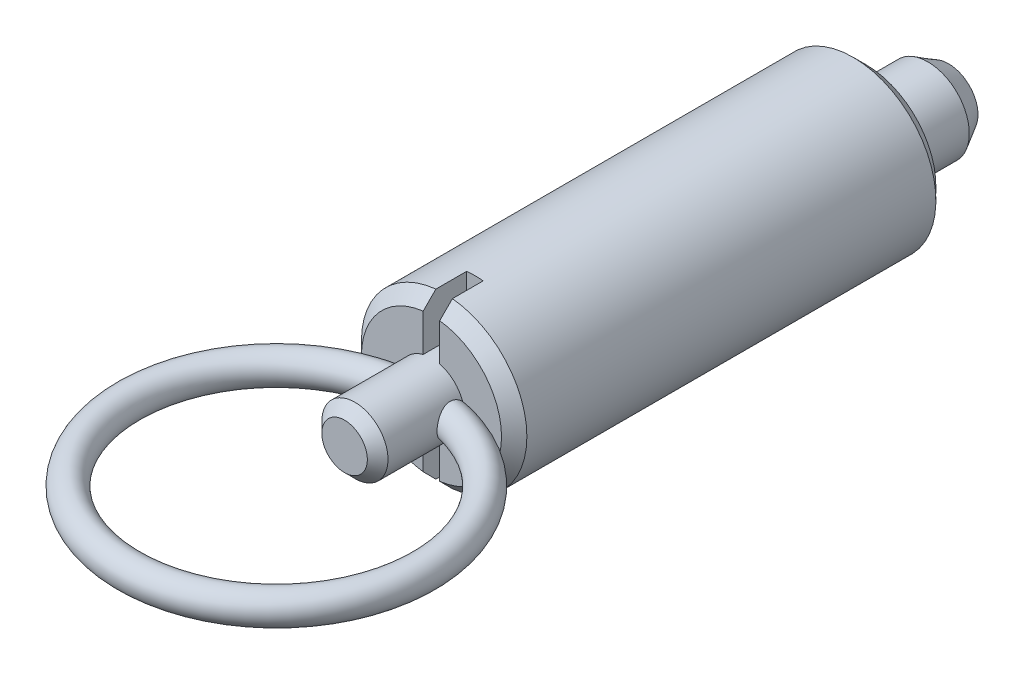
ISO-10303-21;
HEADER;
FILE_DESCRIPTION(('STEP AP214'),'2;1');
FILE_NAME('part.step','',(''),(''),'','','');
FILE_SCHEMA(('AUTOMOTIVE_DESIGN { 1 0 10303 214 1 1 1 1 }'));
ENDSEC;
DATA;
#1=APPLICATION_CONTEXT('core data for automotive mechanical design processes');
#2=APPLICATION_PROTOCOL_DEFINITION('international standard','automotive_design',2000,#1);
#3=PRODUCT_CONTEXT('',#1,'mechanical');
#4=PRODUCT('Part','Part','',(#3));
#5=PRODUCT_RELATED_PRODUCT_CATEGORY('part','',(#4));
#6=PRODUCT_DEFINITION_FORMATION('','',#4);
#7=PRODUCT_DEFINITION_CONTEXT('part definition',#1,'design');
#8=PRODUCT_DEFINITION('design','',#6,#7);
#9=PRODUCT_DEFINITION_SHAPE('','',#8);
#10=(LENGTH_UNIT() NAMED_UNIT(*) SI_UNIT(.MILLI.,.METRE.));
#11=(NAMED_UNIT(*) PLANE_ANGLE_UNIT() SI_UNIT($,.RADIAN.));
#12=(NAMED_UNIT(*) SI_UNIT($,.STERADIAN.) SOLID_ANGLE_UNIT());
#13=UNCERTAINTY_MEASURE_WITH_UNIT(LENGTH_MEASURE(1.E-05),#10,'distance_accuracy_value','');
#14=(GEOMETRIC_REPRESENTATION_CONTEXT(3) GLOBAL_UNCERTAINTY_ASSIGNED_CONTEXT((#13)) GLOBAL_UNIT_ASSIGNED_CONTEXT((#10,
#11,#12)) REPRESENTATION_CONTEXT('',''));
#15=CARTESIAN_POINT('',(0.,0.,0.));
#16=DIRECTION('',(0.,0.,1.));
#17=DIRECTION('',(1.,0.,0.));
#18=AXIS2_PLACEMENT_3D('',#15,#16,#17);
#19=CARTESIAN_POINT('',(-1.42264973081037,0.,-4.));
#20=DIRECTION('',(0.,0.,1.));
#21=DIRECTION('',(0.,1.,0.));
#22=AXIS2_PLACEMENT_3D('',#19,#20,#21);
#23=PLANE('',#22);
#24=CARTESIAN_POINT('',(0.,0.,-3.99999999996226));
#25=DIRECTION('',(0.,0.,1.));
#26=DIRECTION('',(0.,1.,0.));
#27=AXIS2_PLACEMENT_3D('',#24,#25,#26);
#28=CIRCLE('',#27,1.42264973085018);
#29=CARTESIAN_POINT('',(0.,1.42264973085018,-3.99999999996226));
#30=VERTEX_POINT('',#29);
#31=EDGE_CURVE('E158',#30,#30,#28,.T.);
#32=ORIENTED_EDGE('',*,*,#31,.F.);
#33=EDGE_LOOP('',(#32));
#34=FACE_BOUND('',#33,.T.);
#35=ADVANCED_FACE('F14',(#34),#23,.F.);
#36=CARTESIAN_POINT('',(0.,0.,-2.99999999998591));
#37=DIRECTION('',(0.,0.,1.));
#38=DIRECTION('',(0.,1.,0.));
#39=AXIS2_PLACEMENT_3D('',#36,#37,#38);
#40=CONICAL_SURFACE('',#39,2.00000000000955,0.523598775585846);
#41=CARTESIAN_POINT('',(0.,0.,-3.));
#42=DIRECTION('',(0.,0.,1.));
#43=DIRECTION('',(0.,1.,0.));
#44=AXIS2_PLACEMENT_3D('',#41,#42,#43);
#45=CIRCLE('',#44,2.);
#46=CARTESIAN_POINT('',(0.,2.,-3.));
#47=VERTEX_POINT('',#46);
#48=EDGE_CURVE('E157',#47,#47,#45,.T.);
#49=ORIENTED_EDGE('',*,*,#48,.F.);
#50=EDGE_LOOP('',(#49));
#51=FACE_BOUND('',#50,.T.);
#52=ORIENTED_EDGE('',*,*,#31,.T.);
#53=EDGE_LOOP('',(#52));
#54=FACE_BOUND('',#53,.T.);
#55=ADVANCED_FACE('F231',(#51,#54),#40,.T.);
#56=CARTESIAN_POINT('',(0.,0.,-4.));
#57=DIRECTION('',(0.,0.,1.));
#58=DIRECTION('',(0.,1.,0.));
#59=AXIS2_PLACEMENT_3D('',#56,#57,#58);
#60=CYLINDRICAL_SURFACE('',#59,2.);
#61=CARTESIAN_POINT('',(0.,0.,0.));
#62=DIRECTION('',(0.,0.,1.));
#63=DIRECTION('',(0.,1.,0.));
#64=AXIS2_PLACEMENT_3D('',#61,#62,#63);
#65=CIRCLE('',#64,2.);
#66=CARTESIAN_POINT('',(0.,2.,0.));
#67=VERTEX_POINT('',#66);
#68=EDGE_CURVE('E154',#67,#67,#65,.F.);
#69=ORIENTED_EDGE('',*,*,#68,.T.);
#70=EDGE_LOOP('',(#69));
#71=FACE_BOUND('',#70,.T.);
#72=ORIENTED_EDGE('',*,*,#48,.T.);
#73=EDGE_LOOP('',(#72));
#74=FACE_BOUND('',#73,.T.);
#75=ADVANCED_FACE('F227',(#71,#74),#60,.T.);
#76=CARTESIAN_POINT('',(-3.3865,0.,0.));
#77=DIRECTION('',(0.,0.,1.));
#78=DIRECTION('',(0.,1.,0.));
#79=AXIS2_PLACEMENT_3D('',#76,#77,#78);
#80=PLANE('',#79);
#81=CARTESIAN_POINT('',(0.,0.,-5.6843418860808E-11));
#82=DIRECTION('',(0.,0.,1.));
#83=DIRECTION('',(0.,1.,0.));
#84=AXIS2_PLACEMENT_3D('',#81,#82,#83);
#85=CIRCLE('',#84,3.38650000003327);
#86=CARTESIAN_POINT('',(0.,3.38650000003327,-5.6843418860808E-11));
#87=VERTEX_POINT('',#86);
#88=EDGE_CURVE('E24',#87,#87,#85,.T.);
#89=ORIENTED_EDGE('',*,*,#88,.F.);
#90=EDGE_LOOP('',(#89));
#91=FACE_BOUND('',#90,.T.);
#92=ORIENTED_EDGE('',*,*,#68,.F.);
#93=EDGE_LOOP('',(#92));
#94=FACE_BOUND('',#93,.T.);
#95=ADVANCED_FACE('F221',(#91,#94),#80,.F.);
#96=CARTESIAN_POINT('',(0.,0.,0.613499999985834));
#97=DIRECTION('',(0.,0.,1.));
#98=DIRECTION('',(0.,1.,0.));
#99=AXIS2_PLACEMENT_3D('',#96,#97,#98);
#100=CONICAL_SURFACE('',#99,4.00000000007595,0.785398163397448);
#101=CARTESIAN_POINT('',(0.,0.,0.6135));
#102=DIRECTION('',(0.,0.,1.));
#103=DIRECTION('',(0.,1.,0.));
#104=AXIS2_PLACEMENT_3D('',#101,#102,#103);
#105=CIRCLE('',#104,4.);
#106=CARTESIAN_POINT('',(0.,4.,0.6135));
#107=VERTEX_POINT('',#106);
#108=EDGE_CURVE('E9',#107,#107,#105,.T.);
#109=ORIENTED_EDGE('',*,*,#108,.F.);
#110=EDGE_LOOP('',(#109));
#111=FACE_BOUND('',#110,.T.);
#112=ORIENTED_EDGE('',*,*,#88,.T.);
#113=EDGE_LOOP('',(#112));
#114=FACE_BOUND('',#113,.T.);
#115=ADVANCED_FACE('F212',(#111,#114),#100,.T.);
#116=CARTESIAN_POINT('',(0.,0.,-4.));
#117=DIRECTION('',(0.,0.,1.));
#118=DIRECTION('',(0.,1.,0.));
#119=AXIS2_PLACEMENT_3D('',#116,#117,#118);
#120=CYLINDRICAL_SURFACE('',#119,4.);
#121=ORIENTED_EDGE('',*,*,#108,.T.);
#122=EDGE_LOOP('',(#121));
#123=FACE_BOUND('',#122,.T.);
#124=DIRECTION('',(0.,0.,1.));
#125=VECTOR('',#124,1.);
#126=CARTESIAN_POINT('',(0.4,-3.97994974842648,21.001));
#127=LINE('',#126,#125);
#128=CARTESIAN_POINT('',(0.4,-3.97994974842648,18.9));
#129=VERTEX_POINT('',#128);
#130=CARTESIAN_POINT('',(0.4,-3.97994974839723,20.386499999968));
#131=VERTEX_POINT('',#130);
#132=EDGE_CURVE('E298',#129,#131,#127,.T.);
#133=ORIENTED_EDGE('',*,*,#132,.F.);
#134=CARTESIAN_POINT('',(0.,0.,18.9));
#135=DIRECTION('',(0.,0.,1.));
#136=DIRECTION('',(0.,1.,0.));
#137=AXIS2_PLACEMENT_3D('',#134,#135,#136);
#138=CIRCLE('',#137,4.);
#139=CARTESIAN_POINT('',(-0.4,-3.97994974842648,18.9));
#140=VERTEX_POINT('',#139);
#141=EDGE_CURVE('E114',#140,#129,#138,.T.);
#142=ORIENTED_EDGE('',*,*,#141,.F.);
#143=DIRECTION('',(0.,0.,1.));
#144=VECTOR('',#143,1.);
#145=CARTESIAN_POINT('',(-0.4,-3.97994974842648,18.9));
#146=LINE('',#145,#144);
#147=CARTESIAN_POINT('',(-0.4,-3.97994974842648,20.3864999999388));
#148=VERTEX_POINT('',#147);
#149=EDGE_CURVE('E143',#148,#140,#146,.F.);
#150=ORIENTED_EDGE('',*,*,#149,.F.);
#151=CARTESIAN_POINT('',(0.,0.,20.3865));
#152=DIRECTION('',(0.,0.,1.));
#153=DIRECTION('',(0.,1.,0.));
#154=AXIS2_PLACEMENT_3D('',#151,#152,#153);
#155=CIRCLE('',#154,4.);
#156=CARTESIAN_POINT('',(-0.4,3.97994974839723,20.386499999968));
#157=VERTEX_POINT('',#156);
#158=EDGE_CURVE('E135',#148,#157,#155,.F.);
#159=ORIENTED_EDGE('',*,*,#158,.T.);
#160=DIRECTION('',(0.,0.,1.));
#161=VECTOR('',#160,1.);
#162=CARTESIAN_POINT('',(-0.4,3.97994974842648,18.9));
#163=LINE('',#162,#161);
#164=CARTESIAN_POINT('',(-0.4,3.97994974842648,18.9));
#165=VERTEX_POINT('',#164);
#166=EDGE_CURVE('E110',#165,#157,#163,.T.);
#167=ORIENTED_EDGE('',*,*,#166,.F.);
#168=CARTESIAN_POINT('',(0.,0.,18.9));
#169=DIRECTION('',(0.,0.,1.));
#170=DIRECTION('',(0.,1.,0.));
#171=AXIS2_PLACEMENT_3D('',#168,#169,#170);
#172=CIRCLE('',#171,4.);
#173=CARTESIAN_POINT('',(0.4,3.97994974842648,18.9));
#174=VERTEX_POINT('',#173);
#175=EDGE_CURVE('E101',#174,#165,#172,.T.);
#176=ORIENTED_EDGE('',*,*,#175,.F.);
#177=DIRECTION('',(0.,0.,1.));
#178=VECTOR('',#177,1.);
#179=CARTESIAN_POINT('',(0.4,3.97994974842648,21.001));
#180=LINE('',#179,#178);
#181=CARTESIAN_POINT('',(0.4,3.97994974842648,20.3864999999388));
#182=VERTEX_POINT('',#181);
#183=EDGE_CURVE('E107',#182,#174,#180,.F.);
#184=ORIENTED_EDGE('',*,*,#183,.F.);
#185=CARTESIAN_POINT('',(0.,0.,20.3865));
#186=DIRECTION('',(0.,0.,1.));
#187=DIRECTION('',(0.,1.,0.));
#188=AXIS2_PLACEMENT_3D('',#185,#186,#187);
#189=CIRCLE('',#188,4.);
#190=EDGE_CURVE('E137',#182,#131,#189,.F.);
#191=ORIENTED_EDGE('',*,*,#190,.T.);
#192=EDGE_LOOP('',(#133,#142,#150,#159,#167,#176,#184,#191));
#193=FACE_BOUND('',#192,.T.);
#194=ADVANCED_FACE('F104',(#123,#193),#120,.T.);
#195=CARTESIAN_POINT('',(0.,0.,25.2));
#196=DIRECTION('',(0.,0.,-1.));
#197=DIRECTION('',(0.,-1.,0.));
#198=AXIS2_PLACEMENT_3D('',#195,#196,#197);
#199=PLANE('',#198);
#200=CARTESIAN_POINT('',(0.,0.,25.1999999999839));
#201=DIRECTION('',(0.,0.,-1.));
#202=DIRECTION('',(-1.,0.,0.));
#203=AXIS2_PLACEMENT_3D('',#200,#201,#202);
#204=CIRCLE('',#203,1.10000000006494);
#205=CARTESIAN_POINT('',(-1.10000000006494,0.,25.1999999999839));
#206=VERTEX_POINT('',#205);
#207=EDGE_CURVE('E18',#206,#206,#204,.T.);
#208=ORIENTED_EDGE('',*,*,#207,.F.);
#209=EDGE_LOOP('',(#208));
#210=FACE_BOUND('',#209,.T.);
#211=ADVANCED_FACE('F16',(#210),#199,.F.);
#212=CARTESIAN_POINT('',(0.,0.,24.7000000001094));
#213=DIRECTION('',(0.,0.,-1.));
#214=DIRECTION('',(-1.,0.,0.));
#215=AXIS2_PLACEMENT_3D('',#212,#213,#214);
#216=CONICAL_SURFACE('',#215,1.59999999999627,0.785398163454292);
#217=ORIENTED_EDGE('',*,*,#207,.T.);
#218=EDGE_LOOP('',(#217));
#219=FACE_BOUND('',#218,.T.);
#220=CARTESIAN_POINT('',(0.,0.,24.7));
#221=DIRECTION('',(0.,0.,1.));
#222=DIRECTION('',(0.,1.,0.));
#223=AXIS2_PLACEMENT_3D('',#220,#221,#222);
#224=CIRCLE('',#223,1.6);
#225=CARTESIAN_POINT('',(0.,1.6,24.7));
#226=VERTEX_POINT('',#225);
#227=EDGE_CURVE('E151',#226,#226,#224,.F.);
#228=ORIENTED_EDGE('',*,*,#227,.F.);
#229=EDGE_LOOP('',(#228));
#230=FACE_BOUND('',#229,.T.);
#231=ADVANCED_FACE('F208',(#219,#230),#216,.T.);
#232=CARTESIAN_POINT('',(0.,0.,28.5));
#233=DIRECTION('',(0.,1.,0.));
#234=DIRECTION('',(-1.,0.,0.));
#235=AXIS2_PLACEMENT_3D('',#232,#233,#234);
#236=TOROIDAL_SURFACE('',#235,7.125,0.75);
#237=CARTESIAN_POINT('',(-1.50770390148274,-0.535564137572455,21.0000000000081));
#238=CARTESIAN_POINT('',(-1.4978084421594,-0.563438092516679,21.0269662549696));
#239=CARTESIAN_POINT('',(-1.48782914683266,-0.589059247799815,21.0562785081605));
#240=CARTESIAN_POINT('',(-1.46870656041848,-0.635235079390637,21.1189998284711));
#241=CARTESIAN_POINT('',(-1.45956526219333,-0.655777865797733,21.1524182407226));
#242=CARTESIAN_POINT('',(-1.44315524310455,-0.691149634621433,21.2227220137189));
#243=CARTESIAN_POINT('',(-1.43589174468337,-0.705962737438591,21.2596166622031));
#244=CARTESIAN_POINT('',(-1.42417615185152,-0.729311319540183,21.3356972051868));
#245=CARTESIAN_POINT('',(-1.41971878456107,-0.737858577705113,21.3748786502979));
#246=CARTESIAN_POINT('',(-1.414247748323,-0.748288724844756,21.4522842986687));
#247=CARTESIAN_POINT('',(-1.4130692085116,-0.750490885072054,21.4904545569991));
#248=CARTESIAN_POINT('',(-1.41368721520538,-0.749325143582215,21.5666987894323));
#249=CARTESIAN_POINT('',(-1.41548616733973,-0.745952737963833,21.6047726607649));
#250=CARTESIAN_POINT('',(-1.42177479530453,-0.733895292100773,21.6806906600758));
#251=CARTESIAN_POINT('',(-1.4263232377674,-0.72509413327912,21.7185109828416));
#252=CARTESIAN_POINT('',(-1.43755053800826,-0.702570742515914,21.7923399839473));
#253=CARTESIAN_POINT('',(-1.44423160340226,-0.688843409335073,21.82834674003));
#254=CARTESIAN_POINT('',(-1.4601654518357,-0.65446774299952,21.9033073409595));
#255=CARTESIAN_POINT('',(-1.46965502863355,-0.633083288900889,21.9418734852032));
#256=CARTESIAN_POINT('',(-1.48951689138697,-0.584825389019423,22.0152156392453));
#257=CARTESIAN_POINT('',(-1.49989040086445,-0.55794426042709,22.0499862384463));
#258=CARTESIAN_POINT('',(-1.52172725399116,-0.495545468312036,22.1187866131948));
#259=CARTESIAN_POINT('',(-1.53317440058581,-0.459382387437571,22.1522424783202));
#260=CARTESIAN_POINT('',(-1.55446888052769,-0.381128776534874,22.2119238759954));
#261=CARTESIAN_POINT('',(-1.56431968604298,-0.339051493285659,22.2381651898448));
#262=CARTESIAN_POINT('',(-1.57865984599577,-0.262480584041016,22.2754950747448));
#263=CARTESIAN_POINT('',(-1.58387785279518,-0.229186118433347,22.2887697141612));
#264=CARTESIAN_POINT('',(-1.59228285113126,-0.160689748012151,22.3099489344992));
#265=CARTESIAN_POINT('',(-1.59547190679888,-0.125489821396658,22.3178589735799));
#266=CARTESIAN_POINT('',(-1.59949145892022,-0.0539791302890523,22.3278061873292));
#267=CARTESIAN_POINT('',(-1.60031236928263,-0.0176644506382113,22.3298194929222));
#268=CARTESIAN_POINT('',(-1.59947255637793,0.0547647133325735,22.3277505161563));
#269=CARTESIAN_POINT('',(-1.59781156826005,0.0908791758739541,22.3236675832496));
#270=CARTESIAN_POINT('',(-1.59237116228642,0.159597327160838,22.3101411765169));
#271=CARTESIAN_POINT('',(-1.58872711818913,0.192280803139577,22.3010398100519));
#272=CARTESIAN_POINT('',(-1.5797461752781,0.255800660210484,22.2782338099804));
#273=CARTESIAN_POINT('',(-1.57440614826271,0.286633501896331,22.2645206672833));
#274=CARTESIAN_POINT('',(-1.56190055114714,0.348652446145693,22.2316468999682));
#275=CARTESIAN_POINT('',(-1.55461179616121,0.379607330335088,22.2120996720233));
#276=CARTESIAN_POINT('',(-1.53910310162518,0.438272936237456,22.1690094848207));
#277=CARTESIAN_POINT('',(-1.53088366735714,0.465985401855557,22.1454686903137));
#278=CARTESIAN_POINT('',(-1.51247998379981,0.522935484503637,22.0901909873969));
#279=CARTESIAN_POINT('',(-1.50221910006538,0.551462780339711,22.0577466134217));
#280=CARTESIAN_POINT('',(-1.48212350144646,0.603396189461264,21.9888262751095));
#281=CARTESIAN_POINT('',(-1.47228934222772,0.626795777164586,21.9523452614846));
#282=CARTESIAN_POINT('',(-1.45281827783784,0.670799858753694,21.8709359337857));
#283=CARTESIAN_POINT('',(-1.44338149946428,0.690618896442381,21.825529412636));
#284=CARTESIAN_POINT('',(-1.42782369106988,0.722243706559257,21.7314775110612));
#285=CARTESIAN_POINT('',(-1.42169760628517,0.734061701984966,21.6828371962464));
#286=CARTESIAN_POINT('',(-1.41492515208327,0.747010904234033,21.5950754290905));
#287=CARTESIAN_POINT('',(-1.41335218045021,0.749955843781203,21.556292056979));
#288=CARTESIAN_POINT('',(-1.41330721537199,0.75004304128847,21.4787406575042));
#289=CARTESIAN_POINT('',(-1.41483119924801,0.747192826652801,21.439972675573));
#290=CARTESIAN_POINT('',(-1.42092334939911,0.73553983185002,21.3635340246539));
#291=CARTESIAN_POINT('',(-1.42549547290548,0.726729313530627,21.3258648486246));
#292=CARTESIAN_POINT('',(-1.43719787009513,0.703301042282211,21.252733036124));
#293=CARTESIAN_POINT('',(-1.44433263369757,0.688673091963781,21.2172744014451));
#294=CARTESIAN_POINT('',(-1.46044174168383,0.653819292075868,21.149124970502));
#295=CARTESIAN_POINT('',(-1.46943781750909,0.633526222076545,21.1164739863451));
#296=CARTESIAN_POINT('',(-1.48821876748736,0.588057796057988,21.0551366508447));
#297=CARTESIAN_POINT('',(-1.49800187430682,0.562893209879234,21.026441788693));
#298=CARTESIAN_POINT('',(-1.50770390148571,0.535564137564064,21.));
#299=B_SPLINE_CURVE_WITH_KNOTS('',3,(#237,#238,#239,#240,#241,#242,#243,#244,#245,#246,#247,
#248,#249,#250,#251,#252,#253,#254,#255,#256,#257,#258,#259,#260,#261,#262,#263,#264,#265,#266,
#267,#268,#269,#270,#271,#272,#273,#274,#275,#276,#277,#278,#279,#280,#281,#282,#283,#284,#285,
#286,#287,#288,#289,#290,#291,#292,#293,#294,#295,#296,#297,#298),.UNSPECIFIED.,.F.,.F.,(4,2,2,
2,2,2,2,2,2,2,2,2,2,2,2,2,2,2,2,2,2,2,2,2,2,2,2,2,2,2,4),(0.,0.120003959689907,
0.240286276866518,0.360899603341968,0.481285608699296,0.595498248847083,0.709803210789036,
0.826642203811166,0.943602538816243,1.0783956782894,1.21337852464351,1.36432472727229,
1.51493807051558,1.62315692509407,1.73126550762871,1.83981109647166,1.94836826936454,
2.05030490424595,2.15243066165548,2.26400460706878,2.37551826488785,2.50821555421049,
2.64108074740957,2.79161396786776,2.94191670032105,3.05819094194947,3.1743142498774,
3.29058860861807,3.40706768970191,3.5249923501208,3.64265922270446),.UNSPECIFIED.);
#300=CARTESIAN_POINT('',(-1.5077039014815,-0.535564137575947,21.0000000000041));
#301=VERTEX_POINT('',#300);
#302=CARTESIAN_POINT('',(-1.50770390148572,0.53556413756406,21.));
#303=VERTEX_POINT('',#302);
#304=EDGE_CURVE('E324',#301,#303,#299,.T.);
#305=ORIENTED_EDGE('',*,*,#304,.T.);
#306=CARTESIAN_POINT('',(-1.50770390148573,0.535564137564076,21.));
#307=CARTESIAN_POINT('',(-1.53945721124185,0.529423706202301,21.));
#308=CARTESIAN_POINT('',(-1.57114167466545,0.522905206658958,21.));
#309=CARTESIAN_POINT('',(-1.63447227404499,0.508945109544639,21.));
#310=CARTESIAN_POINT('',(-1.66611742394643,0.501499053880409,21.));
#311=CARTESIAN_POINT('',(-1.72921341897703,0.485559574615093,21.));
#312=CARTESIAN_POINT('',(-1.76066374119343,0.477064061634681,21.));
#313=CARTESIAN_POINT('',(-1.82484656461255,0.458384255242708,21.));
#314=CARTESIAN_POINT('',(-1.85756029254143,0.448134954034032,21.));
#315=CARTESIAN_POINT('',(-1.92239671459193,0.426043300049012,21.));
#316=CARTESIAN_POINT('',(-1.95452025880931,0.414203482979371,21.));
#317=CARTESIAN_POINT('',(-2.01793114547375,0.388578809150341,21.));
#318=CARTESIAN_POINT('',(-2.04921957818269,0.37479665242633,21.));
#319=CARTESIAN_POINT('',(-2.11760534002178,0.341382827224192,21.));
#320=CARTESIAN_POINT('',(-2.15441595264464,0.321133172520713,21.0000000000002));
#321=CARTESIAN_POINT('',(-2.207041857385,0.28711035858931,20.9999999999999));
#322=CARTESIAN_POINT('',(-2.22407625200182,0.275227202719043,20.9999999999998));
#323=CARTESIAN_POINT('',(-2.25701983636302,0.250003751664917,21.0000000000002));
#324=CARTESIAN_POINT('',(-2.27293031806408,0.236665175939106,21.0000000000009));
#325=CARTESIAN_POINT('',(-2.30083585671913,0.210447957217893,21.0000000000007));
#326=CARTESIAN_POINT('',(-2.31305712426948,0.197812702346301,21.0000000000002));
#327=CARTESIAN_POINT('',(-2.33592613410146,0.171134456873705,20.9999999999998));
#328=CARTESIAN_POINT('',(-2.34657167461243,0.157089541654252,20.9999999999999));
#329=CARTESIAN_POINT('',(-2.36576155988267,0.127328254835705,21.0000000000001));
#330=CARTESIAN_POINT('',(-2.37427585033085,0.111592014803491,21.));
#331=CARTESIAN_POINT('',(-2.38813399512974,0.0787847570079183,21.));
#332=CARTESIAN_POINT('',(-2.39348796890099,0.0617181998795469,21.));
#333=CARTESIAN_POINT('',(-2.39937665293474,0.0314215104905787,21.));
#334=CARTESIAN_POINT('',(-2.40080927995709,0.0183648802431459,21.));
#335=CARTESIAN_POINT('',(-2.40141192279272,-0.00780210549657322,21.));
#336=CARTESIAN_POINT('',(-2.40058236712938,-0.020912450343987,21.));
#337=CARTESIAN_POINT('',(-2.39674978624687,-0.0467576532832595,21.));
#338=CARTESIAN_POINT('',(-2.39375416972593,-0.0594936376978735,21.));
#339=CARTESIAN_POINT('',(-2.38586204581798,-0.0843695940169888,21.));
#340=CARTESIAN_POINT('',(-2.38096250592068,-0.0965085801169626,21.));
#341=CARTESIAN_POINT('',(-2.36670763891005,-0.126011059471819,21.));
#342=CARTESIAN_POINT('',(-2.35635366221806,-0.14288926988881,21.));
#343=CARTESIAN_POINT('',(-2.33316017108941,-0.174834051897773,21.));
#344=CARTESIAN_POINT('',(-2.32031446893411,-0.189895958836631,21.));
#345=CARTESIAN_POINT('',(-2.29454196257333,-0.216678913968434,21.));
#346=CARTESIAN_POINT('',(-2.28180320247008,-0.228584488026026,21.));
#347=CARTESIAN_POINT('',(-2.25535117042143,-0.251267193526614,21.));
#348=CARTESIAN_POINT('',(-2.24163717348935,-0.262043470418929,21.));
#349=CARTESIAN_POINT('',(-2.21338263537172,-0.28268646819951,21.));
#350=CARTESIAN_POINT('',(-2.19883647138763,-0.292545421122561,21.));
#351=CARTESIAN_POINT('',(-2.16919938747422,-0.311383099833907,21.));
#352=CARTESIAN_POINT('',(-2.15410872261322,-0.320362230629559,21.));
#353=CARTESIAN_POINT('',(-2.10555285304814,-0.347650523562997,21.));
#354=CARTESIAN_POINT('',(-2.07129509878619,-0.36455116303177,21.));
#355=CARTESIAN_POINT('',(-2.00151114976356,-0.395652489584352,21.));
#356=CARTESIAN_POINT('',(-1.96598199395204,-0.409846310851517,21.));
#357=CARTESIAN_POINT('',(-1.89403975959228,-0.436101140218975,21.));
#358=CARTESIAN_POINT('',(-1.85762449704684,-0.44815610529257,21.));
#359=CARTESIAN_POINT('',(-1.78647811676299,-0.469821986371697,21.));
#360=CARTESIAN_POINT('',(-1.75177808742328,-0.479536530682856,21.));
#361=CARTESIAN_POINT('',(-1.68216755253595,-0.497627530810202,21.));
#362=CARTESIAN_POINT('',(-1.64725825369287,-0.506008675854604,21.));
#363=CARTESIAN_POINT('',(-1.57749291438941,-0.521593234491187,21.));
#364=CARTESIAN_POINT('',(-1.54263901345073,-0.528806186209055,21.));
#365=CARTESIAN_POINT('',(-1.5077039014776,-0.535564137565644,21.));
#366=B_SPLINE_CURVE_WITH_KNOTS('',3,(#306,#307,#308,#309,#310,#311,#312,#313,#314,#315,#316,
#317,#318,#319,#320,#321,#322,#323,#324,#325,#326,#327,#328,#329,#330,#331,#332,#333,#334,#335,
#336,#337,#338,#339,#340,#341,#342,#343,#344,#345,#346,#347,#348,#349,#350,#351,#352,#353,#354,
#355,#356,#357,#358,#359,#360,#361,#362,#363,#364,#365),.UNSPECIFIED.,.F.,.F.,(4,2,2,2,2,2,2,2,
2,2,2,2,2,2,2,2,2,2,2,2,2,2,2,2,2,2,2,2,2,4),(0.,0.0970286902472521,0.194543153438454,
0.292254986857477,0.395067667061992,0.497718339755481,0.600227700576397,0.72592186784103,
0.788172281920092,0.850349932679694,0.902988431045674,0.955699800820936,1.00911721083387,
1.06236263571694,1.10158377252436,1.14079748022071,1.17987769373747,1.21902040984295,
1.2780844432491,1.33729707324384,1.38953002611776,1.44180222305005,1.49448300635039,
1.54713942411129,1.66155285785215,1.77625274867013,1.89127171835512,1.99934515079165,
2.10702968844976,2.21378506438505),.UNSPECIFIED.);
#367=EDGE_CURVE('E175',#303,#301,#366,.T.);
#368=ORIENTED_EDGE('',*,*,#367,.T.);
#369=EDGE_LOOP('',(#305,#368));
#370=FACE_BOUND('',#369,.T.);
#371=CARTESIAN_POINT('',(1.50770390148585,-0.535564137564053,21.));
#372=CARTESIAN_POINT('',(1.53945721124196,-0.529423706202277,21.));
#373=CARTESIAN_POINT('',(1.57114167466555,-0.522905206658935,21.));
#374=CARTESIAN_POINT('',(1.63447227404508,-0.508945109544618,21.));
#375=CARTESIAN_POINT('',(1.66611742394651,-0.50149905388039,21.));
#376=CARTESIAN_POINT('',(1.7292134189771,-0.485559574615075,21.));
#377=CARTESIAN_POINT('',(1.76066374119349,-0.477064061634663,21.));
#378=CARTESIAN_POINT('',(1.82484656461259,-0.458384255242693,21.));
#379=CARTESIAN_POINT('',(1.85756029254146,-0.448134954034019,21.));
#380=CARTESIAN_POINT('',(1.92239671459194,-0.426043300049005,21.));
#381=CARTESIAN_POINT('',(1.95452025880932,-0.414203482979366,21.));
#382=CARTESIAN_POINT('',(2.01793114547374,-0.388578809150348,21.));
#383=CARTESIAN_POINT('',(2.04921957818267,-0.374796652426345,21.));
#384=CARTESIAN_POINT('',(2.11760534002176,-0.341382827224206,21.));
#385=CARTESIAN_POINT('',(2.15441595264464,-0.321133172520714,21.0000000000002));
#386=CARTESIAN_POINT('',(2.20704185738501,-0.287110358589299,20.9999999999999));
#387=CARTESIAN_POINT('',(2.22407625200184,-0.275227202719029,20.9999999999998));
#388=CARTESIAN_POINT('',(2.25701983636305,-0.250003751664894,21.0000000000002));
#389=CARTESIAN_POINT('',(2.27293031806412,-0.236665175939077,21.0000000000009));
#390=CARTESIAN_POINT('',(2.30083585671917,-0.21044795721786,21.0000000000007));
#391=CARTESIAN_POINT('',(2.31305712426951,-0.197812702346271,21.0000000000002));
#392=CARTESIAN_POINT('',(2.33592613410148,-0.171134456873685,20.9999999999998));
#393=CARTESIAN_POINT('',(2.34657167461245,-0.15708954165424,20.9999999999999));
#394=CARTESIAN_POINT('',(2.36576155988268,-0.127328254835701,21.0000000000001));
#395=CARTESIAN_POINT('',(2.37427585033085,-0.111592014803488,21.));
#396=CARTESIAN_POINT('',(2.38813399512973,-0.0787847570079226,21.));
#397=CARTESIAN_POINT('',(2.39348796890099,-0.0617181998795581,21.));
#398=CARTESIAN_POINT('',(2.39937665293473,-0.031421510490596,21.));
#399=CARTESIAN_POINT('',(2.40080927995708,-0.0183648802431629,21.));
#400=CARTESIAN_POINT('',(2.40141192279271,0.00780210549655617,21.));
#401=CARTESIAN_POINT('',(2.40058236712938,0.0209124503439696,21.));
#402=CARTESIAN_POINT('',(2.39674978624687,0.0467576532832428,21.));
#403=CARTESIAN_POINT('',(2.39375416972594,0.0594936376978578,21.));
#404=CARTESIAN_POINT('',(2.38586204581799,0.0843695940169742,21.));
#405=CARTESIAN_POINT('',(2.38096250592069,0.0965085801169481,21.));
#406=CARTESIAN_POINT('',(2.36670763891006,0.126011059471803,21.));
#407=CARTESIAN_POINT('',(2.35635366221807,0.142889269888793,21.));
#408=CARTESIAN_POINT('',(2.33316017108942,0.174834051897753,21.));
#409=CARTESIAN_POINT('',(2.32031446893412,0.189895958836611,21.));
#410=CARTESIAN_POINT('',(2.29454196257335,0.216678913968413,21.));
#411=CARTESIAN_POINT('',(2.2818032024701,0.228584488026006,21.));
#412=CARTESIAN_POINT('',(2.25535117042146,0.251267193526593,21.));
#413=CARTESIAN_POINT('',(2.24163717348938,0.262043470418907,21.));
#414=CARTESIAN_POINT('',(2.21338263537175,0.282686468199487,21.));
#415=CARTESIAN_POINT('',(2.19883647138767,0.292545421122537,21.));
#416=CARTESIAN_POINT('',(2.16919938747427,0.31138309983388,21.));
#417=CARTESIAN_POINT('',(2.15410872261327,0.32036223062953,21.));
#418=CARTESIAN_POINT('',(2.10555285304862,0.347650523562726,21.));
#419=CARTESIAN_POINT('',(2.07129509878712,0.364551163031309,21.));
#420=CARTESIAN_POINT('',(2.00151114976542,0.395652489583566,21.));
#421=CARTESIAN_POINT('',(1.96598199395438,0.409846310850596,21.));
#422=CARTESIAN_POINT('',(1.89403975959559,0.436101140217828,21.));
#423=CARTESIAN_POINT('',(1.85762449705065,0.448156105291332,21.));
#424=CARTESIAN_POINT('',(1.78647811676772,0.469821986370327,21.));
#425=CARTESIAN_POINT('',(1.75177808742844,0.479536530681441,21.));
#426=CARTESIAN_POINT('',(1.68216755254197,0.497627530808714,21.));
#427=CARTESIAN_POINT('',(1.64725825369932,0.506008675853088,21.));
#428=CARTESIAN_POINT('',(1.5774929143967,0.521593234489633,21.));
#429=CARTESIAN_POINT('',(1.54263901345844,0.528806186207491,21.));
#430=CARTESIAN_POINT('',(1.50770390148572,0.535564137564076,21.));
#431=B_SPLINE_CURVE_WITH_KNOTS('',3,(#371,#372,#373,#374,#375,#376,#377,#378,#379,#380,#381,
#382,#383,#384,#385,#386,#387,#388,#389,#390,#391,#392,#393,#394,#395,#396,#397,#398,#399,#400,
#401,#402,#403,#404,#405,#406,#407,#408,#409,#410,#411,#412,#413,#414,#415,#416,#417,#418,#419,
#420,#421,#422,#423,#424,#425,#426,#427,#428,#429,#430),.UNSPECIFIED.,.F.,.F.,(4,2,2,2,2,2,2,2,
2,2,2,2,2,2,2,2,2,2,2,2,2,2,2,2,2,2,2,2,2,4),(0.,0.09702869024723,0.194543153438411,
0.292254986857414,0.3950676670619,0.497718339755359,0.600227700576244,0.725921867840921,
0.788172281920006,0.850349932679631,0.902988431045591,0.955699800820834,1.00911721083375,
1.06236263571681,1.10158377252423,1.14079748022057,1.17987769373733,1.21902040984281,
1.27808444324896,1.33729707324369,1.38953002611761,1.44180222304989,1.49448300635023,
1.54713942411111,1.6615528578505,1.77625274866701,1.8912717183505,1.99934515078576,
2.10702968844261,2.21378506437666),.UNSPECIFIED.);
#432=CARTESIAN_POINT('',(1.5077039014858,-0.53556413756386,21.));
#433=VERTEX_POINT('',#432);
#434=CARTESIAN_POINT('',(1.50770390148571,0.535564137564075,21.));
#435=VERTEX_POINT('',#434);
#436=EDGE_CURVE('E165',#433,#435,#431,.T.);
#437=ORIENTED_EDGE('',*,*,#436,.T.);
#438=CARTESIAN_POINT('',(1.50770390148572,0.535564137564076,21.));
#439=CARTESIAN_POINT('',(1.49780844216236,0.563438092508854,21.0269662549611));
#440=CARTESIAN_POINT('',(1.48782914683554,0.589059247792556,21.0562785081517));
#441=CARTESIAN_POINT('',(1.46870656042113,0.635235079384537,21.1189998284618));
#442=CARTESIAN_POINT('',(1.45956526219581,0.655777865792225,21.152418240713));
#443=CARTESIAN_POINT('',(1.44315524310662,0.691149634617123,21.222722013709));
#444=CARTESIAN_POINT('',(1.4358917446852,0.705962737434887,21.2596166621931));
#445=CARTESIAN_POINT('',(1.42417615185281,0.72931131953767,21.3356972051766));
#446=CARTESIAN_POINT('',(1.41971878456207,0.737858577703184,21.3748786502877));
#447=CARTESIAN_POINT('',(1.41424774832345,0.748288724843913,21.4522842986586));
#448=CARTESIAN_POINT('',(1.41306920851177,0.750490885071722,21.490454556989));
#449=CARTESIAN_POINT('',(1.41368721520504,0.749325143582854,21.5666987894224));
#450=CARTESIAN_POINT('',(1.41548616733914,0.74595273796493,21.6047726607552));
#451=CARTESIAN_POINT('',(1.42177479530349,0.733895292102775,21.6806906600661));
#452=CARTESIAN_POINT('',(1.42632323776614,0.725094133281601,21.7185109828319));
#453=CARTESIAN_POINT('',(1.43755053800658,0.702570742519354,21.7923399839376));
#454=CARTESIAN_POINT('',(1.44423160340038,0.688843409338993,21.8283467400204));
#455=CARTESIAN_POINT('',(1.46016545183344,0.654467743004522,21.9033073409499));
#456=CARTESIAN_POINT('',(1.46965502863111,0.633083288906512,21.9418734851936));
#457=CARTESIAN_POINT('',(1.48951689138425,0.584825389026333,22.0152156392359));
#458=CARTESIAN_POINT('',(1.49989040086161,0.557944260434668,22.049986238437));
#459=CARTESIAN_POINT('',(1.52172725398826,0.495545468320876,22.1187866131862));
#460=CARTESIAN_POINT('',(1.53317440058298,0.459382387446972,22.1522424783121));
#461=CARTESIAN_POINT('',(1.5544688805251,0.381128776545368,22.2119238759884));
#462=CARTESIAN_POINT('',(1.56431968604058,0.339051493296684,22.2381651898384));
#463=CARTESIAN_POINT('',(1.57865984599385,0.262480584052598,22.2754950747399));
#464=CARTESIAN_POINT('',(1.58387785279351,0.229186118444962,22.2887697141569));
#465=CARTESIAN_POINT('',(1.5922828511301,0.160689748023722,22.3099489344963));
#466=CARTESIAN_POINT('',(1.59547190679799,0.125489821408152,22.3178589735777));
#467=CARTESIAN_POINT('',(1.59949145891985,0.053979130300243,22.3278061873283));
#468=CARTESIAN_POINT('',(1.60031236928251,0.0176644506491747,22.329819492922));
#469=CARTESIAN_POINT('',(1.5994725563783,-0.0547647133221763,22.3277505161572));
#470=CARTESIAN_POINT('',(1.59781156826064,-0.0908791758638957,22.323667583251));
#471=CARTESIAN_POINT('',(1.59237116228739,-0.159597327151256,22.3101411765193));
#472=CARTESIAN_POINT('',(1.58872711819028,-0.192280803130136,22.3010398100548));
#473=CARTESIAN_POINT('',(1.57974617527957,-0.255800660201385,22.2782338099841));
#474=CARTESIAN_POINT('',(1.57440614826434,-0.286633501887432,22.2645206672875));
#475=CARTESIAN_POINT('',(1.56190055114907,-0.348652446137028,22.2316468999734));
#476=CARTESIAN_POINT('',(1.55461179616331,-0.37960733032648,22.212099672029));
#477=CARTESIAN_POINT('',(1.53910310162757,-0.438272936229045,22.1690094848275));
#478=CARTESIAN_POINT('',(1.53088366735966,-0.465985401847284,22.1454686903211));
#479=CARTESIAN_POINT('',(1.51247998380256,-0.522935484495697,22.0901909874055));
#480=CARTESIAN_POINT('',(1.50221910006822,-0.551462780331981,22.057746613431));
#481=CARTESIAN_POINT('',(1.48212350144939,-0.603396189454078,21.98882627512));
#482=CARTESIAN_POINT('',(1.47228934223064,-0.626795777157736,21.9523452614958));
#483=CARTESIAN_POINT('',(1.45281827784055,-0.67079985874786,21.870935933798));
#484=CARTESIAN_POINT('',(1.44338149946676,-0.690618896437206,21.8255294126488));
#485=CARTESIAN_POINT('',(1.42782369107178,-0.722243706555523,21.7314775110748));
#486=CARTESIAN_POINT('',(1.4216976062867,-0.734061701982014,21.6828371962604));
#487=CARTESIAN_POINT('',(1.41492515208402,-0.747010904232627,21.5950754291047));
#488=CARTESIAN_POINT('',(1.41335218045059,-0.749955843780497,21.556292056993));
#489=CARTESIAN_POINT('',(1.41330721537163,-0.750043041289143,21.4787406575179));
#490=CARTESIAN_POINT('',(1.41483119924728,-0.74719282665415,21.4399726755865));
#491=CARTESIAN_POINT('',(1.42092334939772,-0.735539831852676,21.3635340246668));
#492=CARTESIAN_POINT('',(1.4254954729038,-0.726729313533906,21.325864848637));
#493=CARTESIAN_POINT('',(1.43719787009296,-0.703301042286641,21.2527330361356));
#494=CARTESIAN_POINT('',(1.44433263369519,-0.688673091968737,21.2172744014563));
#495=CARTESIAN_POINT('',(1.46044174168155,-0.653819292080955,21.1491249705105));
#496=CARTESIAN_POINT('',(1.46943781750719,-0.633526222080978,21.1164739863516));
#497=CARTESIAN_POINT('',(1.48821876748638,-0.588057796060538,21.0551366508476));
#498=CARTESIAN_POINT('',(1.49800187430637,-0.562893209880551,21.0264417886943));
#499=CARTESIAN_POINT('',(1.50770390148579,-0.535564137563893,21.));
#500=B_SPLINE_CURVE_WITH_KNOTS('',3,(#438,#439,#440,#441,#442,#443,#444,#445,#446,#447,#448,
#449,#450,#451,#452,#453,#454,#455,#456,#457,#458,#459,#460,#461,#462,#463,#464,#465,#466,#467,
#468,#469,#470,#471,#472,#473,#474,#475,#476,#477,#478,#479,#480,#481,#482,#483,#484,#485,#486,
#487,#488,#489,#490,#491,#492,#493,#494,#495,#496,#497,#498,#499),.UNSPECIFIED.,.F.,.F.,(4,2,2,
2,2,2,2,2,2,2,2,2,2,2,2,2,2,2,2,2,2,2,2,2,2,2,2,2,2,2,4),(0.,0.120003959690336,
0.240286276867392,0.36089960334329,0.481285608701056,0.595498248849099,0.709803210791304,
0.826642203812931,0.943602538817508,1.07839567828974,1.21337852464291,1.36432472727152,
1.51493807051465,1.6231569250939,1.73126550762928,1.83981109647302,1.94836826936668,
2.05030490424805,2.15243066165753,2.26400460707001,2.37551826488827,2.5082155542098,
2.64108074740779,2.79161396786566,2.94191670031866,3.0581909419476,3.17431424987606,
3.29058860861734,3.40706768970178,3.52499235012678,3.64265922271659),.UNSPECIFIED.);
#501=EDGE_CURVE('E483',#435,#433,#500,.T.);
#502=ORIENTED_EDGE('',*,*,#501,.T.);
#503=EDGE_LOOP('',(#437,#502));
#504=FACE_BOUND('',#503,.T.);
#505=ADVANCED_FACE('F182',(#370,#504),#236,.T.);
#506=CARTESIAN_POINT('',(0.,0.,21.));
#507=DIRECTION('',(0.,0.,-1.));
#508=DIRECTION('',(0.,-1.,0.));
#509=AXIS2_PLACEMENT_3D('',#506,#507,#508);
#510=PLANE('',#509);
#511=ORIENTED_EDGE('',*,*,#367,.F.);
#512=CARTESIAN_POINT('',(0.,0.,21.));
#513=DIRECTION('',(0.,0.,1.));
#514=DIRECTION('',(0.,1.,0.));
#515=AXIS2_PLACEMENT_3D('',#512,#513,#514);
#516=CIRCLE('',#515,1.6);
#517=CARTESIAN_POINT('',(-0.4,1.54919333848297,21.));
#518=VERTEX_POINT('',#517);
#519=EDGE_CURVE('E291',#518,#303,#516,.T.);
#520=ORIENTED_EDGE('',*,*,#519,.F.);
#521=DIRECTION('',(0.,-1.,0.));
#522=VECTOR('',#521,1.);
#523=CARTESIAN_POINT('',(-0.4,0.,21.));
#524=LINE('',#523,#522);
#525=CARTESIAN_POINT('',(-0.4,3.36279381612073,20.9999999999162));
#526=VERTEX_POINT('',#525);
#527=EDGE_CURVE('E318',#526,#518,#524,.T.);
#528=ORIENTED_EDGE('',*,*,#527,.F.);
#529=CARTESIAN_POINT('',(0.,0.,20.9999999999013));
#530=DIRECTION('',(0.,0.,-1.));
#531=DIRECTION('',(0.,-1.,0.));
#532=AXIS2_PLACEMENT_3D('',#529,#530,#531);
#533=CIRCLE('',#532,3.38649999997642);
#534=CARTESIAN_POINT('',(-0.4,-3.36279381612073,20.9999999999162));
#535=VERTEX_POINT('',#534);
#536=EDGE_CURVE('E162',#535,#526,#533,.T.);
#537=ORIENTED_EDGE('',*,*,#536,.F.);
#538=DIRECTION('',(0.,-1.,0.));
#539=VECTOR('',#538,1.);
#540=CARTESIAN_POINT('',(-0.4,0.,21.));
#541=LINE('',#540,#539);
#542=CARTESIAN_POINT('',(-0.4,-1.54919333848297,21.));
#543=VERTEX_POINT('',#542);
#544=EDGE_CURVE('E320',#543,#535,#541,.T.);
#545=ORIENTED_EDGE('',*,*,#544,.F.);
#546=CARTESIAN_POINT('',(0.,0.,21.));
#547=DIRECTION('',(0.,0.,1.));
#548=DIRECTION('',(0.,1.,0.));
#549=AXIS2_PLACEMENT_3D('',#546,#547,#548);
#550=CIRCLE('',#549,1.6);
#551=EDGE_CURVE('E289',#301,#543,#550,.T.);
#552=ORIENTED_EDGE('',*,*,#551,.F.);
#553=EDGE_LOOP('',(#511,#520,#528,#537,#545,#552));
#554=FACE_BOUND('',#553,.T.);
#555=ADVANCED_FACE('F196',(#554),#510,.F.);
#556=CARTESIAN_POINT('',(0.,0.,16.8));
#557=DIRECTION('',(0.,0.,1.));
#558=DIRECTION('',(0.,1.,0.));
#559=AXIS2_PLACEMENT_3D('',#556,#557,#558);
#560=CYLINDRICAL_SURFACE('',#559,1.6);
#561=ORIENTED_EDGE('',*,*,#227,.T.);
#562=EDGE_LOOP('',(#561));
#563=FACE_BOUND('',#562,.T.);
#564=CARTESIAN_POINT('',(0.,0.,18.9));
#565=DIRECTION('',(0.,0.,1.));
#566=DIRECTION('',(0.,1.,0.));
#567=AXIS2_PLACEMENT_3D('',#564,#565,#566);
#568=CIRCLE('',#567,1.6);
#569=CARTESIAN_POINT('',(0.4,1.54919333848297,18.9));
#570=VERTEX_POINT('',#569);
#571=CARTESIAN_POINT('',(-0.4,1.54919333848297,18.9));
#572=VERTEX_POINT('',#571);
#573=EDGE_CURVE('E118',#570,#572,#568,.T.);
#574=ORIENTED_EDGE('',*,*,#573,.T.);
#575=DIRECTION('',(0.,0.,1.));
#576=VECTOR('',#575,1.);
#577=CARTESIAN_POINT('',(-0.4,1.54919333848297,18.9));
#578=LINE('',#577,#576);
#579=EDGE_CURVE('E142',#518,#572,#578,.F.);
#580=ORIENTED_EDGE('',*,*,#579,.F.);
#581=ORIENTED_EDGE('',*,*,#519,.T.);
#582=ORIENTED_EDGE('',*,*,#304,.F.);
#583=ORIENTED_EDGE('',*,*,#551,.T.);
#584=DIRECTION('',(0.,0.,1.));
#585=VECTOR('',#584,1.);
#586=CARTESIAN_POINT('',(-0.4,-1.54919333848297,18.9));
#587=LINE('',#586,#585);
#588=CARTESIAN_POINT('',(-0.4,-1.54919333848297,18.9));
#589=VERTEX_POINT('',#588);
#590=EDGE_CURVE('E150',#589,#543,#587,.T.);
#591=ORIENTED_EDGE('',*,*,#590,.F.);
#592=CARTESIAN_POINT('',(0.,0.,18.9));
#593=DIRECTION('',(0.,0.,1.));
#594=DIRECTION('',(0.,1.,0.));
#595=AXIS2_PLACEMENT_3D('',#592,#593,#594);
#596=CIRCLE('',#595,1.6);
#597=CARTESIAN_POINT('',(0.4,-1.54919333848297,18.9));
#598=VERTEX_POINT('',#597);
#599=EDGE_CURVE('E287',#589,#598,#596,.T.);
#600=ORIENTED_EDGE('',*,*,#599,.T.);
#601=DIRECTION('',(0.,0.,1.));
#602=VECTOR('',#601,1.);
#603=CARTESIAN_POINT('',(0.4,-1.54919333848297,21.001));
#604=LINE('',#603,#602);
#605=CARTESIAN_POINT('',(0.4,-1.54919333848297,21.));
#606=VERTEX_POINT('',#605);
#607=EDGE_CURVE('E126',#606,#598,#604,.F.);
#608=ORIENTED_EDGE('',*,*,#607,.F.);
#609=CARTESIAN_POINT('',(0.,0.,21.));
#610=DIRECTION('',(0.,0.,1.));
#611=DIRECTION('',(0.,1.,0.));
#612=AXIS2_PLACEMENT_3D('',#609,#610,#611);
#613=CIRCLE('',#612,1.6);
#614=EDGE_CURVE('E285',#606,#433,#613,.T.);
#615=ORIENTED_EDGE('',*,*,#614,.T.);
#616=ORIENTED_EDGE('',*,*,#501,.F.);
#617=CARTESIAN_POINT('',(0.,0.,21.));
#618=DIRECTION('',(0.,0.,1.));
#619=DIRECTION('',(0.,1.,0.));
#620=AXIS2_PLACEMENT_3D('',#617,#618,#619);
#621=CIRCLE('',#620,1.6);
#622=CARTESIAN_POINT('',(0.4,1.54919333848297,21.));
#623=VERTEX_POINT('',#622);
#624=EDGE_CURVE('E283',#435,#623,#621,.T.);
#625=ORIENTED_EDGE('',*,*,#624,.T.);
#626=DIRECTION('',(0.,0.,1.));
#627=VECTOR('',#626,1.);
#628=CARTESIAN_POINT('',(0.4,1.54919333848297,21.001));
#629=LINE('',#628,#627);
#630=EDGE_CURVE('E122',#570,#623,#629,.T.);
#631=ORIENTED_EDGE('',*,*,#630,.F.);
#632=EDGE_LOOP('',(#574,#580,#581,#582,#583,#591,#600,#608,#615,#616,#625,#631));
#633=FACE_BOUND('',#632,.T.);
#634=ADVANCED_FACE('F191',(#563,#633),#560,.T.);
#635=CARTESIAN_POINT('',(0.,0.,21.));
#636=DIRECTION('',(0.,0.,-1.));
#637=DIRECTION('',(0.,-1.,0.));
#638=AXIS2_PLACEMENT_3D('',#635,#636,#637);
#639=PLANE('',#638);
#640=ORIENTED_EDGE('',*,*,#436,.F.);
#641=ORIENTED_EDGE('',*,*,#614,.F.);
#642=DIRECTION('',(0.,-1.,0.));
#643=VECTOR('',#642,1.);
#644=CARTESIAN_POINT('',(0.4,0.,21.));
#645=LINE('',#644,#643);
#646=CARTESIAN_POINT('',(0.4,-3.36279381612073,20.9999999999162));
#647=VERTEX_POINT('',#646);
#648=EDGE_CURVE('E174',#647,#606,#645,.F.);
#649=ORIENTED_EDGE('',*,*,#648,.F.);
#650=CARTESIAN_POINT('',(0.,0.,20.9999999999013));
#651=DIRECTION('',(0.,0.,-1.));
#652=DIRECTION('',(0.,-1.,0.));
#653=AXIS2_PLACEMENT_3D('',#650,#651,#652);
#654=CIRCLE('',#653,3.38649999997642);
#655=CARTESIAN_POINT('',(0.4,3.36279381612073,20.9999999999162));
#656=VERTEX_POINT('',#655);
#657=EDGE_CURVE('E138',#656,#647,#654,.T.);
#658=ORIENTED_EDGE('',*,*,#657,.F.);
#659=DIRECTION('',(0.,-1.,0.));
#660=VECTOR('',#659,1.);
#661=CARTESIAN_POINT('',(0.4,0.,21.));
#662=LINE('',#661,#660);
#663=EDGE_CURVE('E323',#623,#656,#662,.F.);
#664=ORIENTED_EDGE('',*,*,#663,.F.);
#665=ORIENTED_EDGE('',*,*,#624,.F.);
#666=EDGE_LOOP('',(#640,#641,#649,#658,#664,#665));
#667=FACE_BOUND('',#666,.T.);
#668=ADVANCED_FACE('F186',(#667),#639,.F.);
#669=CARTESIAN_POINT('',(0.,0.,20.3864999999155));
#670=DIRECTION('',(0.,0.,-1.));
#671=DIRECTION('',(0.,-1.,0.));
#672=AXIS2_PLACEMENT_3D('',#669,#670,#671);
#673=CONICAL_SURFACE('',#672,3.99999999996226,0.785398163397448);
#674=CARTESIAN_POINT('',(0.400000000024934,3.36279381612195,20.9999999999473));
#675=CARTESIAN_POINT('',(0.400000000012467,3.46570389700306,20.8978010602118));
#676=CARTESIAN_POINT('',(0.400000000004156,3.56858859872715,20.7955765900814));
#677=CARTESIAN_POINT('',(0.399999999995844,3.77430724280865,20.591076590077));
#678=CARTESIAN_POINT('',(0.399999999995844,3.87714118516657,20.4888010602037));
#679=CARTESIAN_POINT('',(0.4,3.97994974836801,20.3864999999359));
#680=B_SPLINE_CURVE_WITH_KNOTS('',3,(#674,#675,#676,#677,#678,#679),.UNSPECIFIED.,.F.,.F.,(4,2,
4),(0.,0.435104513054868,0.870209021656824),.UNSPECIFIED.);
#681=EDGE_CURVE('E33',#656,#182,#680,.T.);
#682=ORIENTED_EDGE('',*,*,#681,.F.);
#683=ORIENTED_EDGE('',*,*,#657,.T.);
#684=CARTESIAN_POINT('',(0.400000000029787,-3.97994974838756,20.3864999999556));
#685=CARTESIAN_POINT('',(0.400000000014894,-3.87714118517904,20.4888010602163));
#686=CARTESIAN_POINT('',(0.400000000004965,-3.77430724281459,20.5910765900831));
#687=CARTESIAN_POINT('',(0.399999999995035,-3.56858859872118,20.7955765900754));
#688=CARTESIAN_POINT('',(0.399999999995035,-3.4657038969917,20.8978010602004));
#689=CARTESIAN_POINT('',(0.4,-3.36279381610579,20.999999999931));
#690=B_SPLINE_CURVE_WITH_KNOTS('',3,(#684,#685,#686,#687,#688,#689),.UNSPECIFIED.,.F.,.F.,(4,2,
4),(0.,0.43510450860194,0.87020902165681),.UNSPECIFIED.);
#691=EDGE_CURVE('E242',#131,#647,#690,.T.);
#692=ORIENTED_EDGE('',*,*,#691,.F.);
#693=ORIENTED_EDGE('',*,*,#190,.F.);
#694=EDGE_LOOP('',(#682,#683,#692,#693));
#695=FACE_BOUND('',#694,.T.);
#696=ADVANCED_FACE('F190',(#695),#673,.T.);
#697=CARTESIAN_POINT('',(0.4,8.,21.001));
#698=DIRECTION('',(-1.,0.,0.));
#699=DIRECTION('',(0.,-1.,0.));
#700=AXIS2_PLACEMENT_3D('',#697,#698,#699);
#701=PLANE('',#700);
#702=ORIENTED_EDGE('',*,*,#681,.T.);
#703=ORIENTED_EDGE('',*,*,#183,.T.);
#704=DIRECTION('',(0.,-1.,0.));
#705=VECTOR('',#704,1.);
#706=CARTESIAN_POINT('',(0.4,8.,18.9));
#707=LINE('',#706,#705);
#708=EDGE_CURVE('E116',#174,#570,#707,.T.);
#709=ORIENTED_EDGE('',*,*,#708,.T.);
#710=ORIENTED_EDGE('',*,*,#630,.T.);
#711=ORIENTED_EDGE('',*,*,#663,.T.);
#712=EDGE_LOOP('',(#702,#703,#709,#710,#711));
#713=FACE_BOUND('',#712,.T.);
#714=ADVANCED_FACE('F125',(#713),#701,.T.);
#715=CARTESIAN_POINT('',(0.4,8.,18.9));
#716=DIRECTION('',(0.,0.,1.));
#717=DIRECTION('',(0.,1.,0.));
#718=AXIS2_PLACEMENT_3D('',#715,#716,#717);
#719=PLANE('',#718);
#720=ORIENTED_EDGE('',*,*,#708,.F.);
#721=ORIENTED_EDGE('',*,*,#175,.T.);
#722=DIRECTION('',(0.,1.,0.));
#723=VECTOR('',#722,1.);
#724=CARTESIAN_POINT('',(-0.4,8.,18.9));
#725=LINE('',#724,#723);
#726=EDGE_CURVE('E140',#572,#165,#725,.T.);
#727=ORIENTED_EDGE('',*,*,#726,.F.);
#728=ORIENTED_EDGE('',*,*,#573,.F.);
#729=EDGE_LOOP('',(#720,#721,#727,#728));
#730=FACE_BOUND('',#729,.T.);
#731=ADVANCED_FACE('F117',(#730),#719,.T.);
#732=CARTESIAN_POINT('',(-0.4,8.,18.9));
#733=DIRECTION('',(1.,0.,0.));
#734=DIRECTION('',(0.,1.,0.));
#735=AXIS2_PLACEMENT_3D('',#732,#733,#734);
#736=PLANE('',#735);
#737=ORIENTED_EDGE('',*,*,#166,.T.);
#738=CARTESIAN_POINT('',(-0.400000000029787,3.97994974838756,20.3864999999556));
#739=CARTESIAN_POINT('',(-0.400000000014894,3.87714118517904,20.4888010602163));
#740=CARTESIAN_POINT('',(-0.400000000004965,3.77430724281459,20.5910765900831));
#741=CARTESIAN_POINT('',(-0.399999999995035,3.56858859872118,20.7955765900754));
#742=CARTESIAN_POINT('',(-0.399999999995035,3.4657038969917,20.8978010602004));
#743=CARTESIAN_POINT('',(-0.4,3.36279381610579,20.999999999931));
#744=B_SPLINE_CURVE_WITH_KNOTS('',3,(#738,#739,#740,#741,#742,#743),.UNSPECIFIED.,.F.,.F.,(4,2,
4),(0.,0.43510450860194,0.87020902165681),.UNSPECIFIED.);
#745=EDGE_CURVE('E123',#157,#526,#744,.T.);
#746=ORIENTED_EDGE('',*,*,#745,.T.);
#747=ORIENTED_EDGE('',*,*,#527,.T.);
#748=ORIENTED_EDGE('',*,*,#579,.T.);
#749=ORIENTED_EDGE('',*,*,#726,.T.);
#750=EDGE_LOOP('',(#737,#746,#747,#748,#749));
#751=FACE_BOUND('',#750,.T.);
#752=ADVANCED_FACE('F264',(#751),#736,.T.);
#753=CARTESIAN_POINT('',(0.,0.,20.3864999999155));
#754=DIRECTION('',(0.,0.,-1.));
#755=DIRECTION('',(0.,-1.,0.));
#756=AXIS2_PLACEMENT_3D('',#753,#754,#755);
#757=CONICAL_SURFACE('',#756,3.99999999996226,0.785398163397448);
#758=ORIENTED_EDGE('',*,*,#745,.F.);
#759=ORIENTED_EDGE('',*,*,#158,.F.);
#760=CARTESIAN_POINT('',(-0.400000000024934,-3.36279381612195,20.9999999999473));
#761=CARTESIAN_POINT('',(-0.400000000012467,-3.46570389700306,20.8978010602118));
#762=CARTESIAN_POINT('',(-0.400000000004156,-3.56858859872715,20.7955765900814));
#763=CARTESIAN_POINT('',(-0.399999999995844,-3.77430724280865,20.591076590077));
#764=CARTESIAN_POINT('',(-0.399999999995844,-3.87714118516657,20.4888010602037));
#765=CARTESIAN_POINT('',(-0.4,-3.97994974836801,20.3864999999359));
#766=B_SPLINE_CURVE_WITH_KNOTS('',3,(#760,#761,#762,#763,#764,#765),.UNSPECIFIED.,.F.,.F.,(4,2,
4),(0.,0.435104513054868,0.870209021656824),.UNSPECIFIED.);
#767=EDGE_CURVE('E146',#535,#148,#766,.T.);
#768=ORIENTED_EDGE('',*,*,#767,.F.);
#769=ORIENTED_EDGE('',*,*,#536,.T.);
#770=EDGE_LOOP('',(#758,#759,#768,#769));
#771=FACE_BOUND('',#770,.T.);
#772=ADVANCED_FACE('F193',(#771),#757,.T.);
#773=CARTESIAN_POINT('',(-0.4,8.,18.9));
#774=DIRECTION('',(1.,0.,0.));
#775=DIRECTION('',(0.,1.,0.));
#776=AXIS2_PLACEMENT_3D('',#773,#774,#775);
#777=PLANE('',#776);
#778=ORIENTED_EDGE('',*,*,#767,.T.);
#779=ORIENTED_EDGE('',*,*,#149,.T.);
#780=DIRECTION('',(0.,1.,0.));
#781=VECTOR('',#780,1.);
#782=CARTESIAN_POINT('',(-0.4,8.,18.9));
#783=LINE('',#782,#781);
#784=EDGE_CURVE('E147',#140,#589,#783,.T.);
#785=ORIENTED_EDGE('',*,*,#784,.T.);
#786=ORIENTED_EDGE('',*,*,#590,.T.);
#787=ORIENTED_EDGE('',*,*,#544,.T.);
#788=EDGE_LOOP('',(#778,#779,#785,#786,#787));
#789=FACE_BOUND('',#788,.T.);
#790=ADVANCED_FACE('F269',(#789),#777,.T.);
#791=CARTESIAN_POINT('',(0.4,8.,18.9));
#792=DIRECTION('',(0.,0.,1.));
#793=DIRECTION('',(0.,1.,0.));
#794=AXIS2_PLACEMENT_3D('',#791,#792,#793);
#795=PLANE('',#794);
#796=ORIENTED_EDGE('',*,*,#784,.F.);
#797=ORIENTED_EDGE('',*,*,#141,.T.);
#798=DIRECTION('',(0.,-1.,0.));
#799=VECTOR('',#798,1.);
#800=CARTESIAN_POINT('',(0.4,8.,18.9));
#801=LINE('',#800,#799);
#802=EDGE_CURVE('E129',#598,#129,#801,.T.);
#803=ORIENTED_EDGE('',*,*,#802,.F.);
#804=ORIENTED_EDGE('',*,*,#599,.F.);
#805=EDGE_LOOP('',(#796,#797,#803,#804));
#806=FACE_BOUND('',#805,.T.);
#807=ADVANCED_FACE('F272',(#806),#795,.T.);
#808=CARTESIAN_POINT('',(0.4,8.,21.001));
#809=DIRECTION('',(-1.,0.,0.));
#810=DIRECTION('',(0.,-1.,0.));
#811=AXIS2_PLACEMENT_3D('',#808,#809,#810);
#812=PLANE('',#811);
#813=ORIENTED_EDGE('',*,*,#132,.T.);
#814=ORIENTED_EDGE('',*,*,#691,.T.);
#815=ORIENTED_EDGE('',*,*,#648,.T.);
#816=ORIENTED_EDGE('',*,*,#607,.T.);
#817=ORIENTED_EDGE('',*,*,#802,.T.);
#818=EDGE_LOOP('',(#813,#814,#815,#816,#817));
#819=FACE_BOUND('',#818,.T.);
#820=ADVANCED_FACE('F262',(#819),#812,.T.);
#821=CLOSED_SHELL('',(#35,#55,#75,#95,#115,#194,#211,#231,#505,#555,#634,#668,#696,#714,#731,
#752,#772,#790,#807,#820));
#822=MANIFOLD_SOLID_BREP('B1',#821);
#823=ADVANCED_BREP_SHAPE_REPRESENTATION('',(#18,#822),#14);
#824=SHAPE_DEFINITION_REPRESENTATION(#9,#823);
ENDSEC;
END-ISO-10303-21;
